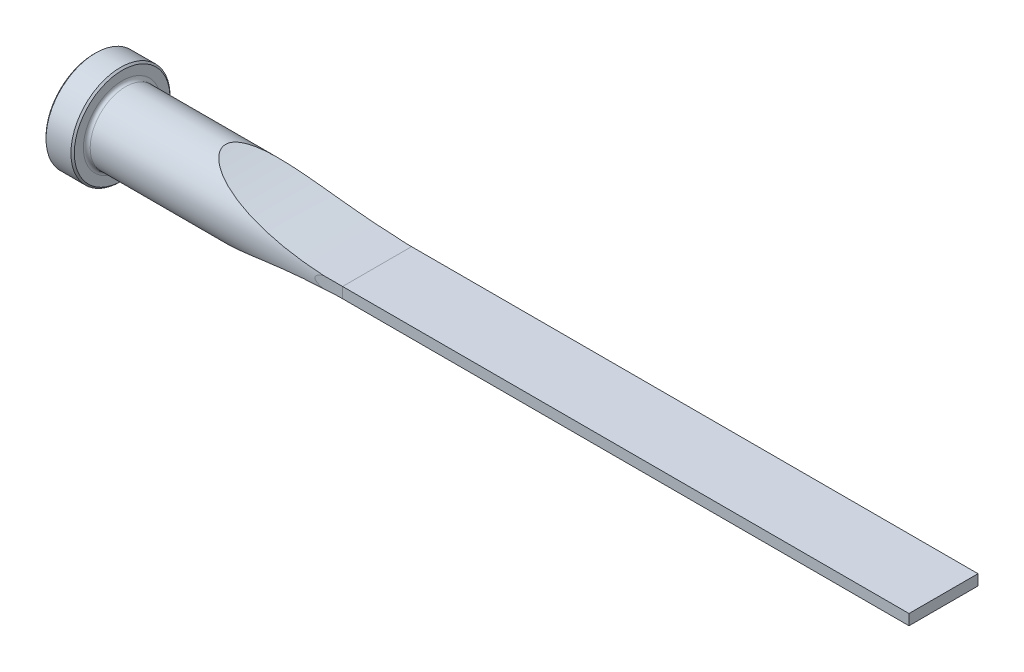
from build123d import *

# Parameters (mm, degrees)
CUT_EXTRUDE1_DEPTH = 192.147130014
CUT_EXTRUDE2_DEPTH = 192.147130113
FILLET1_R          = 0.762
CHAMFER1_SIZE      = 0.381


with BuildPart() as part:
    # Sketch1 → Revolve1 (revolve)
    with BuildSketch(Plane.XY, mode=Mode.PRIVATE) as revolve1_sk:
        Polygon((0, 0), (0, 11.1125), (6.35, 11.1125), (6.35, 7.9375), (190.5, 7.9375), (190.5, 0), align=None)
    revolve(revolve1_sk.sketch.rotate(Axis((0, 0, 0), (1, 0, 0)), 90), axis=Axis((0, 0, 0), (1, 0, 0)))

    # Sketch2 → Cut-Extrude1 (cut, symmetric)
    with BuildSketch(Plane.XY):
        with BuildLine():
            Line((190.5, 7.9375), (190.5, 1.1938))
            Line((190.5, 1.1938), (63.5, 1.1938))
            ThreePointArc((63.5, 1.1938), (46.186494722, 2.896021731), (29.536013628, 7.9375))
            Line((29.536013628, 7.9375), (190.5, 7.9375))
        make_face()
    cut_extrude1 = extrude(amount=CUT_EXTRUDE1_DEPTH, both=True, mode=Mode.SUBTRACT)

    # Mirror1: Cut-Extrude1 across plane
    add(cut_extrude1.mirror(Plane.ZX), mode=Mode.SUBTRACT)

    # Sketch3 → Cut-Extrude2 (cut, symmetric)
    with BuildSketch(Plane(origin=(0, 0, 0), x_dir=(1, 0, 0), z_dir=(0, 1, 0))):
        with BuildLine():
            Line((190.5, 7.9375), (190.5, 7.7343))
            Line((190.5, 7.7343), (63.5, 7.7343))
            ThreePointArc((63.5, 7.7343), (60.49463147, 7.785114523), (57.492698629, 7.9375))
            Line((57.492698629, 7.9375), (190.5, 7.9375))
        make_face()
    cut_extrude2 = extrude(amount=CUT_EXTRUDE2_DEPTH, both=True, mode=Mode.SUBTRACT)

    # Mirror2: Cut-Extrude2 across plane
    add(cut_extrude2.mirror(Plane.XY), mode=Mode.SUBTRACT)

    # Fillet1
    fillet1_edges = [part.edges().sort_by_distance(p)[0] for p in [
        (6.35, 0, -7.9375),
    ]]
    fillet(fillet1_edges, radius=FILLET1_R)

    # Chamfer1
    chamfer1_edges = [part.edges().sort_by_distance(p)[0] for p in [
        (6.35, 0, -11.1125),
        (0, 0, -11.1125),
    ]]
    chamfer(chamfer1_edges, length=CHAMFER1_SIZE)


solid = part.part
